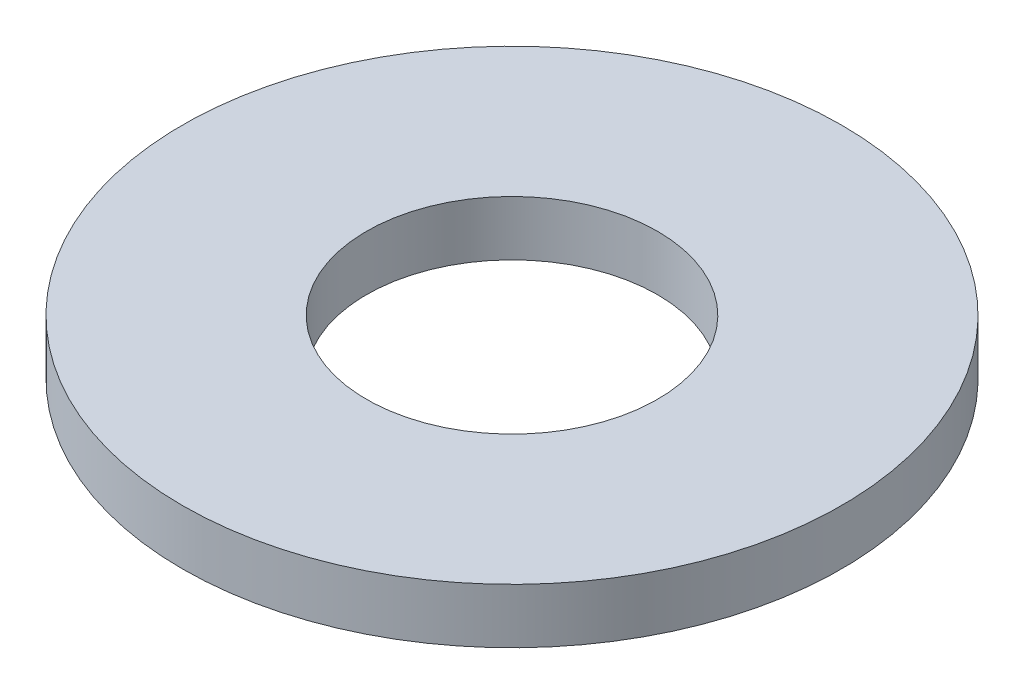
from build123d import *

# Parameters (mm, degrees)
ESQUISSE1_W = 3.35
ESQUISSE1_H = 1


with BuildPart() as part:
    # Esquisse1 → Base (revolve)
    with BuildSketch(Plane.XY, mode=Mode.PRIVATE) as base_sk:
        with Locations((4.325, 0.5)):
            Rectangle(ESQUISSE1_W, ESQUISSE1_H)
    revolve(base_sk.sketch.rotate(Axis((0, 0, 0), (0, 1, 0)), 90), axis=Axis((0, 0, 0), (0, 1, 0)))


solid = part.part
